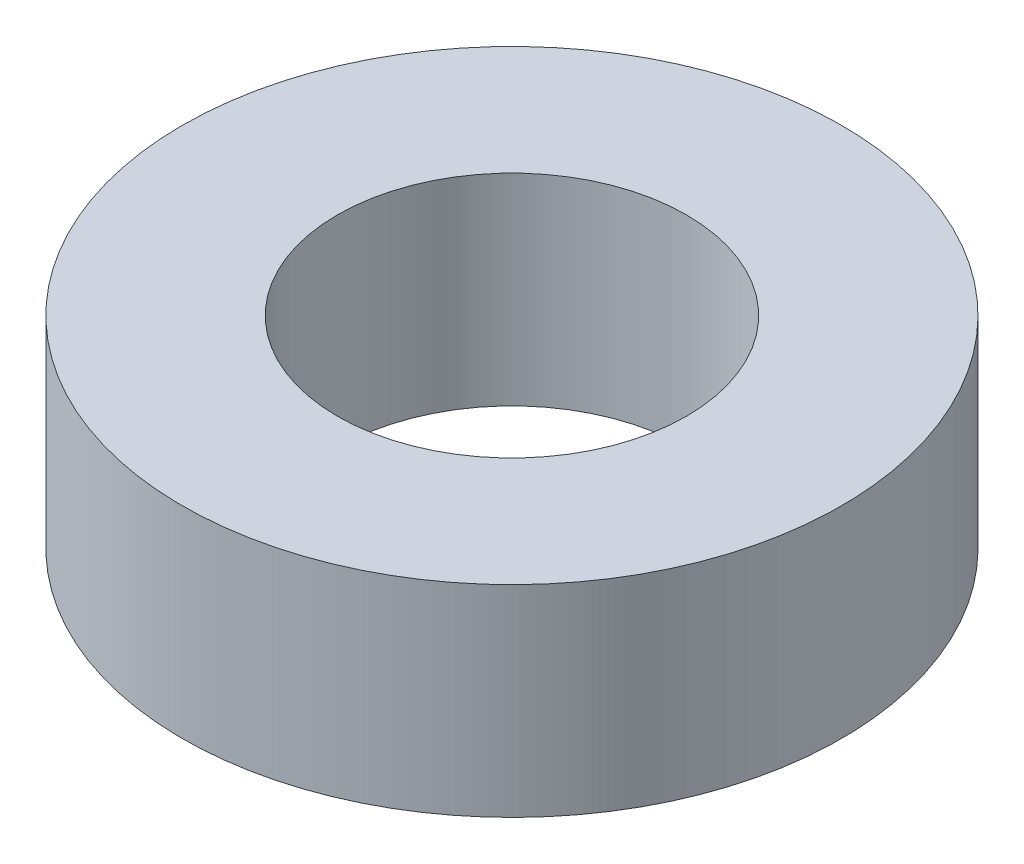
ISO-10303-21;
HEADER;
FILE_DESCRIPTION(('STEP AP214'),'2;1');
FILE_NAME('part.step','',(''),(''),'','','');
FILE_SCHEMA(('AUTOMOTIVE_DESIGN { 1 0 10303 214 1 1 1 1 }'));
ENDSEC;
DATA;
#1=APPLICATION_CONTEXT('core data for automotive mechanical design processes');
#2=APPLICATION_PROTOCOL_DEFINITION('international standard','automotive_design',2000,#1);
#3=PRODUCT_CONTEXT('',#1,'mechanical');
#4=PRODUCT('Part','Part','',(#3));
#5=PRODUCT_RELATED_PRODUCT_CATEGORY('part','',(#4));
#6=PRODUCT_DEFINITION_FORMATION('','',#4);
#7=PRODUCT_DEFINITION_CONTEXT('part definition',#1,'design');
#8=PRODUCT_DEFINITION('design','',#6,#7);
#9=PRODUCT_DEFINITION_SHAPE('','',#8);
#10=(LENGTH_UNIT() NAMED_UNIT(*) SI_UNIT(.MILLI.,.METRE.));
#11=(NAMED_UNIT(*) PLANE_ANGLE_UNIT() SI_UNIT($,.RADIAN.));
#12=(NAMED_UNIT(*) SI_UNIT($,.STERADIAN.) SOLID_ANGLE_UNIT());
#13=UNCERTAINTY_MEASURE_WITH_UNIT(LENGTH_MEASURE(1.E-05),#10,'distance_accuracy_value','');
#14=(GEOMETRIC_REPRESENTATION_CONTEXT(3) GLOBAL_UNCERTAINTY_ASSIGNED_CONTEXT((#13)) GLOBAL_UNIT_ASSIGNED_CONTEXT((#10,
#11,#12)) REPRESENTATION_CONTEXT('',''));
#15=CARTESIAN_POINT('',(0.,0.,0.));
#16=DIRECTION('',(0.,0.,1.));
#17=DIRECTION('',(1.,0.,0.));
#18=AXIS2_PLACEMENT_3D('',#15,#16,#17);
#19=CARTESIAN_POINT('',(0.,5.2,0.));
#20=DIRECTION('',(0.,1.,0.));
#21=DIRECTION('',(-1.,0.,0.));
#22=AXIS2_PLACEMENT_3D('',#19,#20,#21);
#23=PLANE('',#22);
#24=CARTESIAN_POINT('',(0.,5.2,0.));
#25=DIRECTION('',(0.,1.,0.));
#26=DIRECTION('',(-1.,0.,0.));
#27=AXIS2_PLACEMENT_3D('',#24,#25,#26);
#28=CIRCLE('',#27,8.5);
#29=CARTESIAN_POINT('',(-8.5,5.2,0.));
#30=VERTEX_POINT('',#29);
#31=EDGE_CURVE('E26',#30,#30,#28,.F.);
#32=ORIENTED_EDGE('',*,*,#31,.F.);
#33=EDGE_LOOP('',(#32));
#34=FACE_BOUND('',#33,.T.);
#35=CARTESIAN_POINT('',(0.,5.2,0.));
#36=DIRECTION('',(0.,1.,0.));
#37=DIRECTION('',(-1.,0.,0.));
#38=AXIS2_PLACEMENT_3D('',#35,#36,#37);
#39=CIRCLE('',#38,4.5);
#40=CARTESIAN_POINT('',(-4.5,5.2,0.));
#41=VERTEX_POINT('',#40);
#42=EDGE_CURVE('E17',#41,#41,#39,.F.);
#43=ORIENTED_EDGE('',*,*,#42,.T.);
#44=EDGE_LOOP('',(#43));
#45=FACE_BOUND('',#44,.T.);
#46=ADVANCED_FACE('F14',(#34,#45),#23,.T.);
#47=CARTESIAN_POINT('',(0.,0.,0.));
#48=DIRECTION('',(0.,1.,0.));
#49=DIRECTION('',(-1.,0.,0.));
#50=AXIS2_PLACEMENT_3D('',#47,#48,#49);
#51=CYLINDRICAL_SURFACE('',#50,4.5);
#52=ORIENTED_EDGE('',*,*,#42,.F.);
#53=EDGE_LOOP('',(#52));
#54=FACE_BOUND('',#53,.T.);
#55=CARTESIAN_POINT('',(0.,0.,0.));
#56=DIRECTION('',(0.,1.,0.));
#57=DIRECTION('',(-1.,0.,0.));
#58=AXIS2_PLACEMENT_3D('',#55,#56,#57);
#59=CIRCLE('',#58,4.5);
#60=CARTESIAN_POINT('',(-4.5,0.,0.));
#61=VERTEX_POINT('',#60);
#62=EDGE_CURVE('E21',#61,#61,#59,.F.);
#63=ORIENTED_EDGE('',*,*,#62,.T.);
#64=EDGE_LOOP('',(#63));
#65=FACE_BOUND('',#64,.T.);
#66=ADVANCED_FACE('F35',(#54,#65),#51,.F.);
#67=CARTESIAN_POINT('',(0.,0.,0.));
#68=DIRECTION('',(0.,1.,0.));
#69=DIRECTION('',(-1.,0.,0.));
#70=AXIS2_PLACEMENT_3D('',#67,#68,#69);
#71=CYLINDRICAL_SURFACE('',#70,8.5);
#72=ORIENTED_EDGE('',*,*,#31,.T.);
#73=EDGE_LOOP('',(#72));
#74=FACE_BOUND('',#73,.T.);
#75=CARTESIAN_POINT('',(0.,0.,0.));
#76=DIRECTION('',(0.,1.,0.));
#77=DIRECTION('',(-1.,0.,0.));
#78=AXIS2_PLACEMENT_3D('',#75,#76,#77);
#79=CIRCLE('',#78,8.5);
#80=CARTESIAN_POINT('',(-8.5,0.,0.));
#81=VERTEX_POINT('',#80);
#82=EDGE_CURVE('E10',#81,#81,#79,.T.);
#83=ORIENTED_EDGE('',*,*,#82,.T.);
#84=EDGE_LOOP('',(#83));
#85=FACE_BOUND('',#84,.T.);
#86=ADVANCED_FACE('F38',(#74,#85),#71,.T.);
#87=CARTESIAN_POINT('',(0.,0.,0.));
#88=DIRECTION('',(0.,1.,0.));
#89=DIRECTION('',(-1.,0.,0.));
#90=AXIS2_PLACEMENT_3D('',#87,#88,#89);
#91=PLANE('',#90);
#92=ORIENTED_EDGE('',*,*,#82,.F.);
#93=EDGE_LOOP('',(#92));
#94=FACE_BOUND('',#93,.T.);
#95=ORIENTED_EDGE('',*,*,#62,.F.);
#96=EDGE_LOOP('',(#95));
#97=FACE_BOUND('',#96,.T.);
#98=ADVANCED_FACE('F41',(#94,#97),#91,.F.);
#99=CLOSED_SHELL('',(#46,#66,#86,#98));
#100=MANIFOLD_SOLID_BREP('B1',#99);
#101=ADVANCED_BREP_SHAPE_REPRESENTATION('',(#18,#100),#14);
#102=SHAPE_DEFINITION_REPRESENTATION(#9,#101);
ENDSEC;
END-ISO-10303-21;
